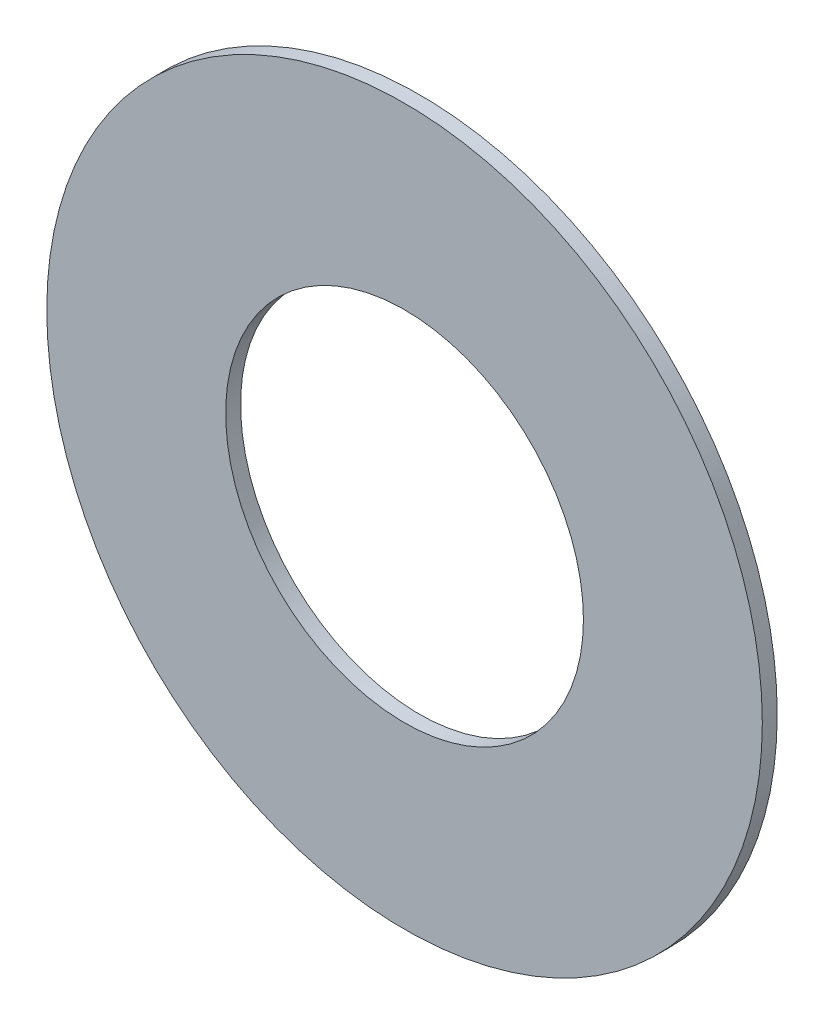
ISO-10303-21;
HEADER;
FILE_DESCRIPTION(('STEP AP214'),'2;1');
FILE_NAME('part.step','',(''),(''),'','','');
FILE_SCHEMA(('AUTOMOTIVE_DESIGN { 1 0 10303 214 1 1 1 1 }'));
ENDSEC;
DATA;
#1=APPLICATION_CONTEXT('core data for automotive mechanical design processes');
#2=APPLICATION_PROTOCOL_DEFINITION('international standard','automotive_design',2000,#1);
#3=PRODUCT_CONTEXT('',#1,'mechanical');
#4=PRODUCT('Part','Part','',(#3));
#5=PRODUCT_RELATED_PRODUCT_CATEGORY('part','',(#4));
#6=PRODUCT_DEFINITION_FORMATION('','',#4);
#7=PRODUCT_DEFINITION_CONTEXT('part definition',#1,'design');
#8=PRODUCT_DEFINITION('design','',#6,#7);
#9=PRODUCT_DEFINITION_SHAPE('','',#8);
#10=(LENGTH_UNIT() NAMED_UNIT(*) SI_UNIT(.MILLI.,.METRE.));
#11=(NAMED_UNIT(*) PLANE_ANGLE_UNIT() SI_UNIT($,.RADIAN.));
#12=(NAMED_UNIT(*) SI_UNIT($,.STERADIAN.) SOLID_ANGLE_UNIT());
#13=UNCERTAINTY_MEASURE_WITH_UNIT(LENGTH_MEASURE(1.E-05),#10,'distance_accuracy_value','');
#14=(GEOMETRIC_REPRESENTATION_CONTEXT(3) GLOBAL_UNCERTAINTY_ASSIGNED_CONTEXT((#13)) GLOBAL_UNIT_ASSIGNED_CONTEXT((#10,
#11,#12)) REPRESENTATION_CONTEXT('',''));
#15=CARTESIAN_POINT('',(0.,0.,0.));
#16=DIRECTION('',(0.,0.,1.));
#17=DIRECTION('',(1.,0.,0.));
#18=AXIS2_PLACEMENT_3D('',#15,#16,#17);
#19=CARTESIAN_POINT('',(0.,0.,0.5));
#20=DIRECTION('',(0.,0.,1.));
#21=DIRECTION('',(1.,0.,0.));
#22=AXIS2_PLACEMENT_3D('',#19,#20,#21);
#23=PLANE('',#22);
#24=CARTESIAN_POINT('',(0.,0.,0.5));
#25=DIRECTION('',(0.,0.,1.));
#26=DIRECTION('',(1.,0.,0.));
#27=AXIS2_PLACEMENT_3D('',#24,#25,#26);
#28=CIRCLE('',#27,12.);
#29=CARTESIAN_POINT('',(12.,0.,0.5));
#30=VERTEX_POINT('',#29);
#31=EDGE_CURVE('E10',#30,#30,#28,.T.);
#32=ORIENTED_EDGE('',*,*,#31,.T.);
#33=EDGE_LOOP('',(#32));
#34=FACE_BOUND('',#33,.T.);
#35=CARTESIAN_POINT('',(0.,0.,0.5));
#36=DIRECTION('',(0.,0.,1.));
#37=DIRECTION('',(1.,0.,0.));
#38=AXIS2_PLACEMENT_3D('',#35,#36,#37);
#39=CIRCLE('',#38,6.);
#40=CARTESIAN_POINT('',(6.,0.,0.5));
#41=VERTEX_POINT('',#40);
#42=EDGE_CURVE('E36',#41,#41,#39,.T.);
#43=ORIENTED_EDGE('',*,*,#42,.F.);
#44=EDGE_LOOP('',(#43));
#45=FACE_BOUND('',#44,.T.);
#46=ADVANCED_FACE('F25',(#34,#45),#23,.T.);
#47=CARTESIAN_POINT('',(0.,0.,0.));
#48=DIRECTION('',(0.,0.,1.));
#49=DIRECTION('',(1.,0.,0.));
#50=AXIS2_PLACEMENT_3D('',#47,#48,#49);
#51=PLANE('',#50);
#52=CARTESIAN_POINT('',(0.,0.,0.));
#53=DIRECTION('',(0.,0.,1.));
#54=DIRECTION('',(1.,0.,0.));
#55=AXIS2_PLACEMENT_3D('',#52,#53,#54);
#56=CIRCLE('',#55,12.);
#57=CARTESIAN_POINT('',(12.,0.,0.));
#58=VERTEX_POINT('',#57);
#59=EDGE_CURVE('E32',#58,#58,#56,.T.);
#60=ORIENTED_EDGE('',*,*,#59,.F.);
#61=EDGE_LOOP('',(#60));
#62=FACE_BOUND('',#61,.T.);
#63=CARTESIAN_POINT('',(0.,0.,0.));
#64=DIRECTION('',(0.,0.,1.));
#65=DIRECTION('',(1.,0.,0.));
#66=AXIS2_PLACEMENT_3D('',#63,#64,#65);
#67=CIRCLE('',#66,6.);
#68=CARTESIAN_POINT('',(6.,0.,0.));
#69=VERTEX_POINT('',#68);
#70=EDGE_CURVE('E40',#69,#69,#67,.T.);
#71=ORIENTED_EDGE('',*,*,#70,.T.);
#72=EDGE_LOOP('',(#71));
#73=FACE_BOUND('',#72,.T.);
#74=ADVANCED_FACE('F46',(#62,#73),#51,.F.);
#75=CARTESIAN_POINT('',(0.,0.,0.5));
#76=DIRECTION('',(0.,0.,-1.));
#77=DIRECTION('',(-1.,0.,0.));
#78=AXIS2_PLACEMENT_3D('',#75,#76,#77);
#79=CYLINDRICAL_SURFACE('',#78,12.);
#80=ORIENTED_EDGE('',*,*,#31,.F.);
#81=EDGE_LOOP('',(#80));
#82=FACE_BOUND('',#81,.T.);
#83=ORIENTED_EDGE('',*,*,#59,.T.);
#84=EDGE_LOOP('',(#83));
#85=FACE_BOUND('',#84,.T.);
#86=ADVANCED_FACE('F27',(#82,#85),#79,.T.);
#87=CARTESIAN_POINT('',(0.,0.,0.5));
#88=DIRECTION('',(0.,0.,-1.));
#89=DIRECTION('',(-1.,0.,0.));
#90=AXIS2_PLACEMENT_3D('',#87,#88,#89);
#91=CYLINDRICAL_SURFACE('',#90,6.);
#92=ORIENTED_EDGE('',*,*,#42,.T.);
#93=EDGE_LOOP('',(#92));
#94=FACE_BOUND('',#93,.T.);
#95=ORIENTED_EDGE('',*,*,#70,.F.);
#96=EDGE_LOOP('',(#95));
#97=FACE_BOUND('',#96,.T.);
#98=ADVANCED_FACE('F48',(#94,#97),#91,.F.);
#99=CLOSED_SHELL('',(#46,#74,#86,#98));
#100=MANIFOLD_SOLID_BREP('B2',#99);
#101=ADVANCED_BREP_SHAPE_REPRESENTATION('',(#18,#100),#14);
#102=SHAPE_DEFINITION_REPRESENTATION(#9,#101);
ENDSEC;
END-ISO-10303-21;
